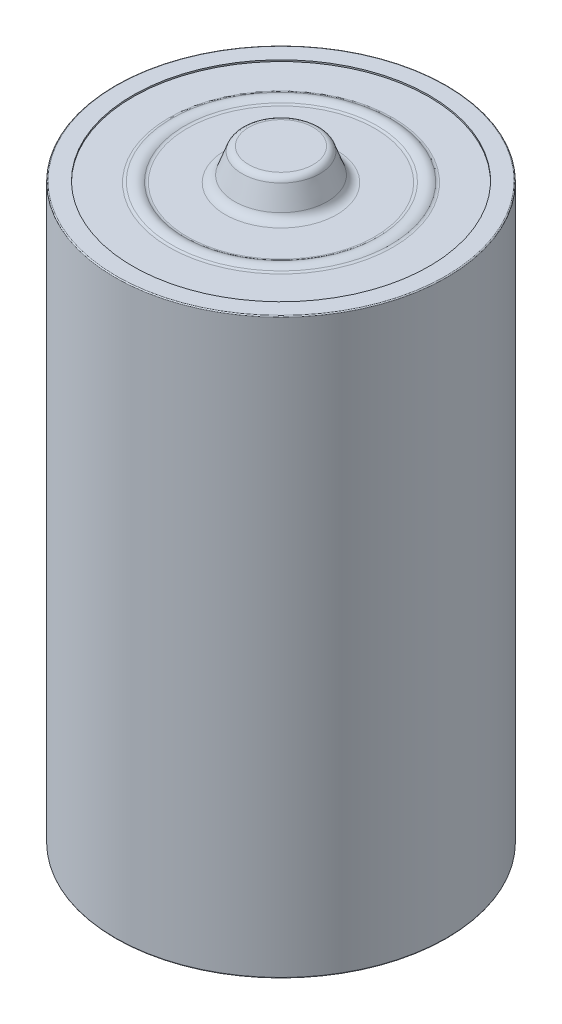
ISO-10303-21;
HEADER;
FILE_DESCRIPTION(('STEP AP214'),'2;1');
FILE_NAME('part.step','',(''),(''),'','','');
FILE_SCHEMA(('AUTOMOTIVE_DESIGN { 1 0 10303 214 1 1 1 1 }'));
ENDSEC;
DATA;
#1=APPLICATION_CONTEXT('core data for automotive mechanical design processes');
#2=APPLICATION_PROTOCOL_DEFINITION('international standard','automotive_design',2000,#1);
#3=PRODUCT_CONTEXT('',#1,'mechanical');
#4=PRODUCT('Part','Part','',(#3));
#5=PRODUCT_RELATED_PRODUCT_CATEGORY('part','',(#4));
#6=PRODUCT_DEFINITION_FORMATION('','',#4);
#7=PRODUCT_DEFINITION_CONTEXT('part definition',#1,'design');
#8=PRODUCT_DEFINITION('design','',#6,#7);
#9=PRODUCT_DEFINITION_SHAPE('','',#8);
#10=(LENGTH_UNIT() NAMED_UNIT(*) SI_UNIT(.MILLI.,.METRE.));
#11=(NAMED_UNIT(*) PLANE_ANGLE_UNIT() SI_UNIT($,.RADIAN.));
#12=(NAMED_UNIT(*) SI_UNIT($,.STERADIAN.) SOLID_ANGLE_UNIT());
#13=UNCERTAINTY_MEASURE_WITH_UNIT(LENGTH_MEASURE(1.E-05),#10,'distance_accuracy_value','');
#14=(GEOMETRIC_REPRESENTATION_CONTEXT(3) GLOBAL_UNCERTAINTY_ASSIGNED_CONTEXT((#13)) GLOBAL_UNIT_ASSIGNED_CONTEXT((#10,
#11,#12)) REPRESENTATION_CONTEXT('',''));
#15=CARTESIAN_POINT('',(0.,0.,0.));
#16=DIRECTION('',(0.,0.,1.));
#17=DIRECTION('',(1.,0.,0.));
#18=AXIS2_PLACEMENT_3D('',#15,#16,#17);
#19=CARTESIAN_POINT('',(0.,59.6,0.));
#20=DIRECTION('',(0.,-1.,0.));
#21=DIRECTION('',(0.,0.,-1.));
#22=AXIS2_PLACEMENT_3D('',#19,#20,#21);
#23=TOROIDAL_SURFACE('',#22,3.2098547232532,0.7);
#24=CARTESIAN_POINT('',(0.,59.839414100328,0.));
#25=DIRECTION('',(0.,-1.,0.));
#26=DIRECTION('',(0.,0.,-1.));
#27=AXIS2_PLACEMENT_3D('',#24,#25,#26);
#28=CIRCLE('',#27,3.86763955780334);
#29=CARTESIAN_POINT('',(0.,59.839414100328,-3.86763955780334));
#30=VERTEX_POINT('',#29);
#31=EDGE_CURVE('E122',#30,#30,#28,.T.);
#32=ORIENTED_EDGE('',*,*,#31,.F.);
#33=EDGE_LOOP('',(#32));
#34=FACE_BOUND('',#33,.T.);
#35=CARTESIAN_POINT('',(0.,60.3,0.));
#36=DIRECTION('',(0.,-1.,0.));
#37=DIRECTION('',(0.,0.,-1.));
#38=AXIS2_PLACEMENT_3D('',#35,#36,#37);
#39=CIRCLE('',#38,3.2098547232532);
#40=CARTESIAN_POINT('',(0.,60.3,-3.2098547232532));
#41=VERTEX_POINT('',#40);
#42=EDGE_CURVE('E10',#41,#41,#39,.T.);
#43=ORIENTED_EDGE('',*,*,#42,.T.);
#44=EDGE_LOOP('',(#43));
#45=FACE_BOUND('',#44,.T.);
#46=ADVANCED_FACE('F31',(#34,#45),#23,.T.);
#47=CARTESIAN_POINT('',(0.,60.3,3.2098547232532));
#48=DIRECTION('',(0.,-1.,0.));
#49=DIRECTION('',(0.,0.,-1.));
#50=AXIS2_PLACEMENT_3D('',#47,#48,#49);
#51=PLANE('',#50);
#52=ORIENTED_EDGE('',*,*,#42,.F.);
#53=EDGE_LOOP('',(#52));
#54=FACE_BOUND('',#53,.T.);
#55=ADVANCED_FACE('F129',(#54),#51,.F.);
#56=CARTESIAN_POINT('',(0.,1.,0.));
#57=DIRECTION('',(0.,1.,0.));
#58=DIRECTION('',(0.,0.,1.));
#59=AXIS2_PLACEMENT_3D('',#56,#57,#58);
#60=PLANE('',#59);
#61=CARTESIAN_POINT('',(0.,1.,0.));
#62=DIRECTION('',(0.,-1.,0.));
#63=DIRECTION('',(0.,0.,-1.));
#64=AXIS2_PLACEMENT_3D('',#61,#62,#63);
#65=CIRCLE('',#64,1.32679491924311);
#66=CARTESIAN_POINT('',(0.,1.,-1.32679491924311));
#67=VERTEX_POINT('',#66);
#68=EDGE_CURVE('E37',#67,#67,#65,.T.);
#69=ORIENTED_EDGE('',*,*,#68,.T.);
#70=EDGE_LOOP('',(#69));
#71=FACE_BOUND('',#70,.T.);
#72=ADVANCED_FACE('F133',(#71),#60,.F.);
#73=CARTESIAN_POINT('',(0.,0.7,0.));
#74=DIRECTION('',(0.,-1.,0.));
#75=DIRECTION('',(0.,0.,-1.));
#76=AXIS2_PLACEMENT_3D('',#73,#74,#75);
#77=TOROIDAL_SURFACE('',#76,1.32679491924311,0.3);
#78=ORIENTED_EDGE('',*,*,#68,.F.);
#79=EDGE_LOOP('',(#78));
#80=FACE_BOUND('',#79,.T.);
#81=CARTESIAN_POINT('',(0.,0.849999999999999,0.));
#82=DIRECTION('',(0.,-1.,0.));
#83=DIRECTION('',(0.,0.,-1.));
#84=AXIS2_PLACEMENT_3D('',#81,#82,#83);
#85=CIRCLE('',#84,1.58660254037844);
#86=CARTESIAN_POINT('',(0.,0.849999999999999,-1.58660254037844));
#87=VERTEX_POINT('',#86);
#88=EDGE_CURVE('E41',#87,#87,#85,.T.);
#89=ORIENTED_EDGE('',*,*,#88,.T.);
#90=EDGE_LOOP('',(#89));
#91=FACE_BOUND('',#90,.T.);
#92=ADVANCED_FACE('F138',(#80,#91),#77,.F.);
#93=CARTESIAN_POINT('',(0.,0.450000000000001,0.));
#94=DIRECTION('',(0.,-1.,0.));
#95=DIRECTION('',(0.,0.,-1.));
#96=AXIS2_PLACEMENT_3D('',#93,#94,#95);
#97=CONICAL_SURFACE('',#96,1.81754264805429,0.523598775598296);
#98=ORIENTED_EDGE('',*,*,#88,.F.);
#99=EDGE_LOOP('',(#98));
#100=FACE_BOUND('',#99,.T.);
#101=CARTESIAN_POINT('',(0.,0.450000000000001,0.));
#102=DIRECTION('',(0.,-1.,0.));
#103=DIRECTION('',(0.,0.,-1.));
#104=AXIS2_PLACEMENT_3D('',#101,#102,#103);
#105=CIRCLE('',#104,1.81754264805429);
#106=CARTESIAN_POINT('',(0.,0.450000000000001,-1.81754264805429));
#107=VERTEX_POINT('',#106);
#108=EDGE_CURVE('E45',#107,#107,#105,.T.);
#109=ORIENTED_EDGE('',*,*,#108,.T.);
#110=EDGE_LOOP('',(#109));
#111=FACE_BOUND('',#110,.T.);
#112=ADVANCED_FACE('F143',(#100,#111),#97,.F.);
#113=CARTESIAN_POINT('',(0.,0.7,0.));
#114=DIRECTION('',(0.,-1.,0.));
#115=DIRECTION('',(0.,0.,-1.));
#116=AXIS2_PLACEMENT_3D('',#113,#114,#115);
#117=TOROIDAL_SURFACE('',#116,2.25055534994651,0.5);
#118=ORIENTED_EDGE('',*,*,#108,.F.);
#119=EDGE_LOOP('',(#118));
#120=FACE_BOUND('',#119,.T.);
#121=CARTESIAN_POINT('',(0.,0.2,0.));
#122=DIRECTION('',(0.,-1.,0.));
#123=DIRECTION('',(0.,0.,-1.));
#124=AXIS2_PLACEMENT_3D('',#121,#122,#123);
#125=CIRCLE('',#124,2.25055534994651);
#126=CARTESIAN_POINT('',(0.,0.2,-2.25055534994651));
#127=VERTEX_POINT('',#126);
#128=EDGE_CURVE('E50',#127,#127,#125,.T.);
#129=ORIENTED_EDGE('',*,*,#128,.T.);
#130=EDGE_LOOP('',(#129));
#131=FACE_BOUND('',#130,.T.);
#132=ADVANCED_FACE('F147',(#120,#131),#117,.T.);
#133=CARTESIAN_POINT('',(0.,0.199999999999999,2.25055534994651));
#134=DIRECTION('',(0.,1.,0.));
#135=DIRECTION('',(0.,0.,1.));
#136=AXIS2_PLACEMENT_3D('',#133,#134,#135);
#137=PLANE('',#136);
#138=ORIENTED_EDGE('',*,*,#128,.F.);
#139=EDGE_LOOP('',(#138));
#140=FACE_BOUND('',#139,.T.);
#141=CARTESIAN_POINT('',(0.,0.199999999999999,0.));
#142=DIRECTION('',(0.,-1.,0.));
#143=DIRECTION('',(0.,0.,-1.));
#144=AXIS2_PLACEMENT_3D('',#141,#142,#143);
#145=CIRCLE('',#144,2.7618802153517);
#146=CARTESIAN_POINT('',(0.,0.199999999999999,-2.7618802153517));
#147=VERTEX_POINT('',#146);
#148=EDGE_CURVE('E53',#147,#147,#145,.T.);
#149=ORIENTED_EDGE('',*,*,#148,.T.);
#150=EDGE_LOOP('',(#149));
#151=FACE_BOUND('',#150,.T.);
#152=ADVANCED_FACE('F151',(#140,#151),#137,.F.);
#153=CARTESIAN_POINT('',(0.,16.9722672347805,0.));
#154=DIRECTION('',(0.,-1.,0.));
#155=DIRECTION('',(0.,0.,-1.));
#156=AXIS2_PLACEMENT_3D('',#153,#154,#155);
#157=DEGENERATE_TOROIDAL_SURFACE('',#156,2.7618802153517,16.7722672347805,.T.);
#158=ORIENTED_EDGE('',*,*,#148,.F.);
#159=EDGE_LOOP('',(#158));
#160=FACE_BOUND('',#159,.T.);
#161=CARTESIAN_POINT('',(0.,0.345657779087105,0.));
#162=DIRECTION('',(0.,-1.,0.));
#163=DIRECTION('',(0.,0.,-1.));
#164=AXIS2_PLACEMENT_3D('',#161,#162,#163);
#165=CIRCLE('',#164,4.96751078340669);
#166=CARTESIAN_POINT('',(0.,0.345657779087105,-4.96751078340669));
#167=VERTEX_POINT('',#166);
#168=EDGE_CURVE('E56',#167,#167,#165,.T.);
#169=ORIENTED_EDGE('',*,*,#168,.T.);
#170=EDGE_LOOP('',(#169));
#171=FACE_BOUND('',#170,.T.);
#172=ADVANCED_FACE('F155',(#160,#171),#157,.T.);
#173=CARTESIAN_POINT('',(0.,-0.15,0.));
#174=DIRECTION('',(0.,-1.,0.));
#175=DIRECTION('',(0.,0.,-1.));
#176=AXIS2_PLACEMENT_3D('',#173,#174,#175);
#177=TOROIDAL_SURFACE('',#176,5.03326309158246,0.500000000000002);
#178=ORIENTED_EDGE('',*,*,#168,.F.);
#179=EDGE_LOOP('',(#178));
#180=FACE_BOUND('',#179,.T.);
#181=CARTESIAN_POINT('',(0.,0.35,0.));
#182=DIRECTION('',(0.,-1.,0.));
#183=DIRECTION('',(0.,0.,-1.));
#184=AXIS2_PLACEMENT_3D('',#181,#182,#183);
#185=CIRCLE('',#184,5.03326309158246);
#186=CARTESIAN_POINT('',(0.,0.35,-5.03326309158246));
#187=VERTEX_POINT('',#186);
#188=EDGE_CURVE('E59',#187,#187,#185,.T.);
#189=ORIENTED_EDGE('',*,*,#188,.T.);
#190=EDGE_LOOP('',(#189));
#191=FACE_BOUND('',#190,.T.);
#192=ADVANCED_FACE('F159',(#180,#191),#177,.F.);
#193=CARTESIAN_POINT('',(0.,0.35,7.55522356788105));
#194=DIRECTION('',(0.,1.,0.));
#195=DIRECTION('',(0.,0.,1.));
#196=AXIS2_PLACEMENT_3D('',#193,#194,#195);
#197=PLANE('',#196);
#198=ORIENTED_EDGE('',*,*,#188,.F.);
#199=EDGE_LOOP('',(#198));
#200=FACE_BOUND('',#199,.T.);
#201=CARTESIAN_POINT('',(0.,0.35,0.));
#202=DIRECTION('',(0.,-1.,0.));
#203=DIRECTION('',(0.,0.,-1.));
#204=AXIS2_PLACEMENT_3D('',#201,#202,#203);
#205=CIRCLE('',#204,7.55522356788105);
#206=CARTESIAN_POINT('',(0.,0.35,-7.55522356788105));
#207=VERTEX_POINT('',#206);
#208=EDGE_CURVE('E62',#207,#207,#205,.T.);
#209=ORIENTED_EDGE('',*,*,#208,.T.);
#210=EDGE_LOOP('',(#209));
#211=FACE_BOUND('',#210,.T.);
#212=ADVANCED_FACE('F163',(#200,#211),#197,.F.);
#213=CARTESIAN_POINT('',(0.,-0.15,0.));
#214=DIRECTION('',(0.,-1.,0.));
#215=DIRECTION('',(0.,0.,-1.));
#216=AXIS2_PLACEMENT_3D('',#213,#214,#215);
#217=TOROIDAL_SURFACE('',#216,7.55522356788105,0.5);
#218=ORIENTED_EDGE('',*,*,#208,.F.);
#219=EDGE_LOOP('',(#218));
#220=FACE_BOUND('',#219,.T.);
#221=CARTESIAN_POINT('',(0.,0.238589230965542,0.));
#222=DIRECTION('',(0.,-1.,0.));
#223=DIRECTION('',(0.,0.,-1.));
#224=AXIS2_PLACEMENT_3D('',#221,#222,#223);
#225=CIRCLE('',#224,7.86986369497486);
#226=CARTESIAN_POINT('',(0.,0.238589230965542,-7.86986369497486));
#227=VERTEX_POINT('',#226);
#228=EDGE_CURVE('E65',#227,#227,#225,.T.);
#229=ORIENTED_EDGE('',*,*,#228,.T.);
#230=EDGE_LOOP('',(#229));
#231=FACE_BOUND('',#230,.T.);
#232=ADVANCED_FACE('F167',(#220,#231),#217,.F.);
#233=CARTESIAN_POINT('',(0.,1.17120338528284,0.));
#234=DIRECTION('',(0.,-1.,0.));
#235=DIRECTION('',(0.,0.,-1.));
#236=AXIS2_PLACEMENT_3D('',#233,#234,#235);
#237=TOROIDAL_SURFACE('',#236,8.625,1.2);
#238=ORIENTED_EDGE('',*,*,#228,.F.);
#239=EDGE_LOOP('',(#238));
#240=FACE_BOUND('',#239,.T.);
#241=CARTESIAN_POINT('',(0.,0.238589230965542,0.));
#242=DIRECTION('',(0.,-1.,0.));
#243=DIRECTION('',(0.,0.,-1.));
#244=AXIS2_PLACEMENT_3D('',#241,#242,#243);
#245=CIRCLE('',#244,9.38013630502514);
#246=CARTESIAN_POINT('',(0.,0.238589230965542,-9.38013630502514));
#247=VERTEX_POINT('',#246);
#248=EDGE_CURVE('E68',#247,#247,#245,.T.);
#249=ORIENTED_EDGE('',*,*,#248,.T.);
#250=EDGE_LOOP('',(#249));
#251=FACE_BOUND('',#250,.T.);
#252=ADVANCED_FACE('F171',(#240,#251),#237,.T.);
#253=CARTESIAN_POINT('',(0.,-0.15,0.));
#254=DIRECTION('',(0.,-1.,0.));
#255=DIRECTION('',(0.,0.,-1.));
#256=AXIS2_PLACEMENT_3D('',#253,#254,#255);
#257=TOROIDAL_SURFACE('',#256,9.69477643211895,0.5);
#258=ORIENTED_EDGE('',*,*,#248,.F.);
#259=EDGE_LOOP('',(#258));
#260=FACE_BOUND('',#259,.T.);
#261=CARTESIAN_POINT('',(0.,0.35,0.));
#262=DIRECTION('',(0.,-1.,0.));
#263=DIRECTION('',(0.,0.,-1.));
#264=AXIS2_PLACEMENT_3D('',#261,#262,#263);
#265=CIRCLE('',#264,9.69477643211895);
#266=CARTESIAN_POINT('',(0.,0.35,-9.69477643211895));
#267=VERTEX_POINT('',#266);
#268=EDGE_CURVE('E71',#267,#267,#265,.T.);
#269=ORIENTED_EDGE('',*,*,#268,.T.);
#270=EDGE_LOOP('',(#269));
#271=FACE_BOUND('',#270,.T.);
#272=ADVANCED_FACE('F175',(#260,#271),#257,.F.);
#273=CARTESIAN_POINT('',(0.,0.35,12.5));
#274=DIRECTION('',(0.,1.,0.));
#275=DIRECTION('',(0.,0.,1.));
#276=AXIS2_PLACEMENT_3D('',#273,#274,#275);
#277=PLANE('',#276);
#278=ORIENTED_EDGE('',*,*,#268,.F.);
#279=EDGE_LOOP('',(#278));
#280=FACE_BOUND('',#279,.T.);
#281=CARTESIAN_POINT('',(0.,0.35,0.));
#282=DIRECTION('',(0.,-1.,0.));
#283=DIRECTION('',(0.,0.,-1.));
#284=AXIS2_PLACEMENT_3D('',#281,#282,#283);
#285=CIRCLE('',#284,12.5);
#286=CARTESIAN_POINT('',(0.,0.35,-12.5));
#287=VERTEX_POINT('',#286);
#288=EDGE_CURVE('E74',#287,#287,#285,.T.);
#289=ORIENTED_EDGE('',*,*,#288,.T.);
#290=EDGE_LOOP('',(#289));
#291=FACE_BOUND('',#290,.T.);
#292=ADVANCED_FACE('F179',(#280,#291),#277,.F.);
#293=CARTESIAN_POINT('',(0.,0.,0.));
#294=DIRECTION('',(0.,-1.,0.));
#295=DIRECTION('',(0.,0.,-1.));
#296=AXIS2_PLACEMENT_3D('',#293,#294,#295);
#297=CYLINDRICAL_SURFACE('',#296,12.5);
#298=ORIENTED_EDGE('',*,*,#288,.F.);
#299=EDGE_LOOP('',(#298));
#300=FACE_BOUND('',#299,.T.);
#301=CARTESIAN_POINT('',(0.,0.25,0.));
#302=DIRECTION('',(0.,-1.,0.));
#303=DIRECTION('',(0.,0.,-1.));
#304=AXIS2_PLACEMENT_3D('',#301,#302,#303);
#305=CIRCLE('',#304,12.5);
#306=CARTESIAN_POINT('',(0.,0.25,-12.5));
#307=VERTEX_POINT('',#306);
#308=EDGE_CURVE('E77',#307,#307,#305,.T.);
#309=ORIENTED_EDGE('',*,*,#308,.T.);
#310=EDGE_LOOP('',(#309));
#311=FACE_BOUND('',#310,.T.);
#312=ADVANCED_FACE('F183',(#300,#311),#297,.F.);
#313=CARTESIAN_POINT('',(0.,0.25,13.5));
#314=DIRECTION('',(0.,1.,0.));
#315=DIRECTION('',(0.,0.,1.));
#316=AXIS2_PLACEMENT_3D('',#313,#314,#315);
#317=PLANE('',#316);
#318=ORIENTED_EDGE('',*,*,#308,.F.);
#319=EDGE_LOOP('',(#318));
#320=FACE_BOUND('',#319,.T.);
#321=CARTESIAN_POINT('',(0.,0.25,0.));
#322=DIRECTION('',(0.,-1.,0.));
#323=DIRECTION('',(0.,0.,-1.));
#324=AXIS2_PLACEMENT_3D('',#321,#322,#323);
#325=CIRCLE('',#324,13.5);
#326=CARTESIAN_POINT('',(0.,0.25,-13.5));
#327=VERTEX_POINT('',#326);
#328=EDGE_CURVE('E80',#327,#327,#325,.T.);
#329=ORIENTED_EDGE('',*,*,#328,.T.);
#330=EDGE_LOOP('',(#329));
#331=FACE_BOUND('',#330,.T.);
#332=ADVANCED_FACE('F187',(#320,#331),#317,.F.);
#333=CARTESIAN_POINT('',(0.,0.,0.));
#334=DIRECTION('',(0.,-1.,0.));
#335=DIRECTION('',(0.,0.,-1.));
#336=AXIS2_PLACEMENT_3D('',#333,#334,#335);
#337=CYLINDRICAL_SURFACE('',#336,13.5);
#338=ORIENTED_EDGE('',*,*,#328,.F.);
#339=EDGE_LOOP('',(#338));
#340=FACE_BOUND('',#339,.T.);
#341=CARTESIAN_POINT('',(0.,0.2,0.));
#342=DIRECTION('',(0.,-1.,0.));
#343=DIRECTION('',(0.,0.,-1.));
#344=AXIS2_PLACEMENT_3D('',#341,#342,#343);
#345=CIRCLE('',#344,13.5);
#346=CARTESIAN_POINT('',(0.,0.2,-13.5));
#347=VERTEX_POINT('',#346);
#348=EDGE_CURVE('E83',#347,#347,#345,.T.);
#349=ORIENTED_EDGE('',*,*,#348,.T.);
#350=EDGE_LOOP('',(#349));
#351=FACE_BOUND('',#350,.T.);
#352=ADVANCED_FACE('F191',(#340,#351),#337,.F.);
#353=CARTESIAN_POINT('',(0.,0.2,16.4));
#354=DIRECTION('',(0.,1.,0.));
#355=DIRECTION('',(0.,0.,1.));
#356=AXIS2_PLACEMENT_3D('',#353,#354,#355);
#357=PLANE('',#356);
#358=ORIENTED_EDGE('',*,*,#348,.F.);
#359=EDGE_LOOP('',(#358));
#360=FACE_BOUND('',#359,.T.);
#361=CARTESIAN_POINT('',(0.,0.2,0.));
#362=DIRECTION('',(0.,-1.,0.));
#363=DIRECTION('',(0.,0.,-1.));
#364=AXIS2_PLACEMENT_3D('',#361,#362,#363);
#365=CIRCLE('',#364,16.4);
#366=CARTESIAN_POINT('',(0.,0.2,-16.4));
#367=VERTEX_POINT('',#366);
#368=EDGE_CURVE('E86',#367,#367,#365,.T.);
#369=ORIENTED_EDGE('',*,*,#368,.T.);
#370=EDGE_LOOP('',(#369));
#371=FACE_BOUND('',#370,.T.);
#372=ADVANCED_FACE('F195',(#360,#371),#357,.F.);
#373=CARTESIAN_POINT('',(0.,0.3,0.));
#374=DIRECTION('',(0.,-1.,0.));
#375=DIRECTION('',(0.,0.,-1.));
#376=AXIS2_PLACEMENT_3D('',#373,#374,#375);
#377=TOROIDAL_SURFACE('',#376,16.4,0.0999999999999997);
#378=ORIENTED_EDGE('',*,*,#368,.F.);
#379=EDGE_LOOP('',(#378));
#380=FACE_BOUND('',#379,.T.);
#381=CARTESIAN_POINT('',(0.,0.300000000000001,0.));
#382=DIRECTION('',(0.,-1.,0.));
#383=DIRECTION('',(0.,0.,-1.));
#384=AXIS2_PLACEMENT_3D('',#381,#382,#383);
#385=CIRCLE('',#384,16.5);
#386=CARTESIAN_POINT('',(0.,0.300000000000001,-16.5));
#387=VERTEX_POINT('',#386);
#388=EDGE_CURVE('E89',#387,#387,#385,.T.);
#389=ORIENTED_EDGE('',*,*,#388,.T.);
#390=EDGE_LOOP('',(#389));
#391=FACE_BOUND('',#390,.T.);
#392=ADVANCED_FACE('F199',(#380,#391),#377,.T.);
#393=CARTESIAN_POINT('',(0.,0.,0.));
#394=DIRECTION('',(0.,-1.,0.));
#395=DIRECTION('',(0.,0.,-1.));
#396=AXIS2_PLACEMENT_3D('',#393,#394,#395);
#397=CYLINDRICAL_SURFACE('',#396,16.5);
#398=ORIENTED_EDGE('',*,*,#388,.F.);
#399=EDGE_LOOP('',(#398));
#400=FACE_BOUND('',#399,.T.);
#401=CARTESIAN_POINT('',(0.,57.2,0.));
#402=DIRECTION('',(0.,-1.,0.));
#403=DIRECTION('',(0.,0.,-1.));
#404=AXIS2_PLACEMENT_3D('',#401,#402,#403);
#405=CIRCLE('',#404,16.5);
#406=CARTESIAN_POINT('',(0.,57.2,-16.5));
#407=VERTEX_POINT('',#406);
#408=EDGE_CURVE('E92',#407,#407,#405,.T.);
#409=ORIENTED_EDGE('',*,*,#408,.T.);
#410=EDGE_LOOP('',(#409));
#411=FACE_BOUND('',#410,.T.);
#412=ADVANCED_FACE('F203',(#400,#411),#397,.T.);
#413=CARTESIAN_POINT('',(0.,57.2,0.));
#414=DIRECTION('',(0.,-1.,0.));
#415=DIRECTION('',(0.,0.,-1.));
#416=AXIS2_PLACEMENT_3D('',#413,#414,#415);
#417=TOROIDAL_SURFACE('',#416,16.4,0.100000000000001);
#418=ORIENTED_EDGE('',*,*,#408,.F.);
#419=EDGE_LOOP('',(#418));
#420=FACE_BOUND('',#419,.T.);
#421=CARTESIAN_POINT('',(0.,57.3,0.));
#422=DIRECTION('',(0.,-1.,0.));
#423=DIRECTION('',(0.,0.,-1.));
#424=AXIS2_PLACEMENT_3D('',#421,#422,#423);
#425=CIRCLE('',#424,16.4);
#426=CARTESIAN_POINT('',(0.,57.3,-16.4));
#427=VERTEX_POINT('',#426);
#428=EDGE_CURVE('E95',#427,#427,#425,.T.);
#429=ORIENTED_EDGE('',*,*,#428,.T.);
#430=EDGE_LOOP('',(#429));
#431=FACE_BOUND('',#430,.T.);
#432=ADVANCED_FACE('F207',(#420,#431),#417,.T.);
#433=CARTESIAN_POINT('',(0.,57.3,16.4));
#434=DIRECTION('',(0.,-1.,0.));
#435=DIRECTION('',(0.,0.,-1.));
#436=AXIS2_PLACEMENT_3D('',#433,#434,#435);
#437=PLANE('',#436);
#438=ORIENTED_EDGE('',*,*,#428,.F.);
#439=EDGE_LOOP('',(#438));
#440=FACE_BOUND('',#439,.T.);
#441=CARTESIAN_POINT('',(0.,57.3,0.));
#442=DIRECTION('',(0.,-1.,0.));
#443=DIRECTION('',(0.,0.,-1.));
#444=AXIS2_PLACEMENT_3D('',#441,#442,#443);
#445=CIRCLE('',#444,14.75);
#446=CARTESIAN_POINT('',(0.,57.3,-14.75));
#447=VERTEX_POINT('',#446);
#448=EDGE_CURVE('E98',#447,#447,#445,.T.);
#449=ORIENTED_EDGE('',*,*,#448,.T.);
#450=EDGE_LOOP('',(#449));
#451=FACE_BOUND('',#450,.T.);
#452=ADVANCED_FACE('F211',(#440,#451),#437,.F.);
#453=CARTESIAN_POINT('',(0.,0.,0.));
#454=DIRECTION('',(0.,-1.,0.));
#455=DIRECTION('',(0.,0.,-1.));
#456=AXIS2_PLACEMENT_3D('',#453,#454,#455);
#457=CYLINDRICAL_SURFACE('',#456,14.75);
#458=ORIENTED_EDGE('',*,*,#448,.F.);
#459=EDGE_LOOP('',(#458));
#460=FACE_BOUND('',#459,.T.);
#461=CARTESIAN_POINT('',(0.,57.15,0.));
#462=DIRECTION('',(0.,-1.,0.));
#463=DIRECTION('',(0.,0.,-1.));
#464=AXIS2_PLACEMENT_3D('',#461,#462,#463);
#465=CIRCLE('',#464,14.75);
#466=CARTESIAN_POINT('',(0.,57.15,-14.75));
#467=VERTEX_POINT('',#466);
#468=EDGE_CURVE('E101',#467,#467,#465,.T.);
#469=ORIENTED_EDGE('',*,*,#468,.T.);
#470=EDGE_LOOP('',(#469));
#471=FACE_BOUND('',#470,.T.);
#472=ADVANCED_FACE('F215',(#460,#471),#457,.F.);
#473=CARTESIAN_POINT('',(0.,57.15,14.75));
#474=DIRECTION('',(0.,-1.,0.));
#475=DIRECTION('',(0.,0.,-1.));
#476=AXIS2_PLACEMENT_3D('',#473,#474,#475);
#477=PLANE('',#476);
#478=ORIENTED_EDGE('',*,*,#468,.F.);
#479=EDGE_LOOP('',(#478));
#480=FACE_BOUND('',#479,.T.);
#481=CARTESIAN_POINT('',(0.,57.15,0.));
#482=DIRECTION('',(0.,-1.,0.));
#483=DIRECTION('',(0.,0.,-1.));
#484=AXIS2_PLACEMENT_3D('',#481,#482,#483);
#485=CIRCLE('',#484,11.1587080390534);
#486=CARTESIAN_POINT('',(0.,57.15,-11.1587080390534));
#487=VERTEX_POINT('',#486);
#488=EDGE_CURVE('E104',#487,#487,#485,.T.);
#489=ORIENTED_EDGE('',*,*,#488,.T.);
#490=EDGE_LOOP('',(#489));
#491=FACE_BOUND('',#490,.T.);
#492=ADVANCED_FACE('F219',(#480,#491),#477,.F.);
#493=CARTESIAN_POINT('',(0.,57.65,0.));
#494=DIRECTION('',(0.,-1.,0.));
#495=DIRECTION('',(0.,0.,-1.));
#496=AXIS2_PLACEMENT_3D('',#493,#494,#495);
#497=TOROIDAL_SURFACE('',#496,11.1587080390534,0.500000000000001);
#498=ORIENTED_EDGE('',*,*,#488,.F.);
#499=EDGE_LOOP('',(#498));
#500=FACE_BOUND('',#499,.T.);
#501=CARTESIAN_POINT('',(0.,57.2274265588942,0.));
#502=DIRECTION('',(0.,-1.,0.));
#503=DIRECTION('',(0.,0.,-1.));
#504=AXIS2_PLACEMENT_3D('',#501,#502,#503);
#505=CIRCLE('',#504,10.8914409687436);
#506=CARTESIAN_POINT('',(0.,57.2274265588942,-10.8914409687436));
#507=VERTEX_POINT('',#506);
#508=EDGE_CURVE('E107',#507,#507,#505,.T.);
#509=ORIENTED_EDGE('',*,*,#508,.T.);
#510=EDGE_LOOP('',(#509));
#511=FACE_BOUND('',#510,.T.);
#512=ADVANCED_FACE('F223',(#500,#511),#497,.F.);
#513=CARTESIAN_POINT('',(0.,56.2132503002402,0.));
#514=DIRECTION('',(0.,-1.,0.));
#515=DIRECTION('',(0.,0.,-1.));
#516=AXIS2_PLACEMENT_3D('',#513,#514,#515);
#517=TOROIDAL_SURFACE('',#516,10.25,1.2);
#518=ORIENTED_EDGE('',*,*,#508,.F.);
#519=EDGE_LOOP('',(#518));
#520=FACE_BOUND('',#519,.T.);
#521=CARTESIAN_POINT('',(0.,57.2274265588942,0.));
#522=DIRECTION('',(0.,-1.,0.));
#523=DIRECTION('',(0.,0.,-1.));
#524=AXIS2_PLACEMENT_3D('',#521,#522,#523);
#525=CIRCLE('',#524,9.60855903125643);
#526=CARTESIAN_POINT('',(0.,57.2274265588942,-9.60855903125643));
#527=VERTEX_POINT('',#526);
#528=EDGE_CURVE('E110',#527,#527,#525,.T.);
#529=ORIENTED_EDGE('',*,*,#528,.T.);
#530=EDGE_LOOP('',(#529));
#531=FACE_BOUND('',#530,.T.);
#532=ADVANCED_FACE('F227',(#520,#531),#517,.T.);
#533=CARTESIAN_POINT('',(0.,57.65,0.));
#534=DIRECTION('',(0.,-1.,0.));
#535=DIRECTION('',(0.,0.,-1.));
#536=AXIS2_PLACEMENT_3D('',#533,#534,#535);
#537=TOROIDAL_SURFACE('',#536,9.34129196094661,0.500000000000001);
#538=ORIENTED_EDGE('',*,*,#528,.F.);
#539=EDGE_LOOP('',(#538));
#540=FACE_BOUND('',#539,.T.);
#541=CARTESIAN_POINT('',(0.,57.15,0.));
#542=DIRECTION('',(0.,-1.,0.));
#543=DIRECTION('',(0.,0.,-1.));
#544=AXIS2_PLACEMENT_3D('',#541,#542,#543);
#545=CIRCLE('',#544,9.34129196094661);
#546=CARTESIAN_POINT('',(0.,57.15,-9.34129196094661));
#547=VERTEX_POINT('',#546);
#548=EDGE_CURVE('E113',#547,#547,#545,.T.);
#549=ORIENTED_EDGE('',*,*,#548,.T.);
#550=EDGE_LOOP('',(#549));
#551=FACE_BOUND('',#550,.T.);
#552=ADVANCED_FACE('F231',(#540,#551),#537,.F.);
#553=CARTESIAN_POINT('',(0.,57.15,9.34129196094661));
#554=DIRECTION('',(0.,-1.,0.));
#555=DIRECTION('',(0.,0.,-1.));
#556=AXIS2_PLACEMENT_3D('',#553,#554,#555);
#557=PLANE('',#556);
#558=ORIENTED_EDGE('',*,*,#548,.F.);
#559=EDGE_LOOP('',(#558));
#560=FACE_BOUND('',#559,.T.);
#561=CARTESIAN_POINT('',(0.,57.15,0.));
#562=DIRECTION('',(0.,-1.,0.));
#563=DIRECTION('',(0.,0.,-1.));
#564=AXIS2_PLACEMENT_3D('',#561,#562,#563);
#565=CIRCLE('',#564,5.54671377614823);
#566=CARTESIAN_POINT('',(0.,57.15,-5.54671377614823));
#567=VERTEX_POINT('',#566);
#568=EDGE_CURVE('E116',#567,#567,#565,.T.);
#569=ORIENTED_EDGE('',*,*,#568,.T.);
#570=EDGE_LOOP('',(#569));
#571=FACE_BOUND('',#570,.T.);
#572=ADVANCED_FACE('F235',(#560,#571),#557,.F.);
#573=CARTESIAN_POINT('',(0.,58.15,0.));
#574=DIRECTION('',(0.,-1.,0.));
#575=DIRECTION('',(0.,0.,-1.));
#576=AXIS2_PLACEMENT_3D('',#573,#574,#575);
#577=TOROIDAL_SURFACE('',#576,5.54671377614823,1.);
#578=ORIENTED_EDGE('',*,*,#568,.F.);
#579=EDGE_LOOP('',(#578));
#580=FACE_BOUND('',#579,.T.);
#581=CARTESIAN_POINT('',(0.,57.8079798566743,0.));
#582=DIRECTION('',(0.,-1.,0.));
#583=DIRECTION('',(0.,0.,-1.));
#584=AXIS2_PLACEMENT_3D('',#581,#582,#583);
#585=CIRCLE('',#584,4.60702115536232);
#586=CARTESIAN_POINT('',(0.,57.8079798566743,-4.60702115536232));
#587=VERTEX_POINT('',#586);
#588=EDGE_CURVE('E119',#587,#587,#585,.T.);
#589=ORIENTED_EDGE('',*,*,#588,.T.);
#590=EDGE_LOOP('',(#589));
#591=FACE_BOUND('',#590,.T.);
#592=ADVANCED_FACE('F239',(#580,#591),#577,.F.);
#593=CARTESIAN_POINT('',(0.,59.839414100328,0.));
#594=DIRECTION('',(0.,-1.,0.));
#595=DIRECTION('',(0.,0.,-1.));
#596=AXIS2_PLACEMENT_3D('',#593,#594,#595);
#597=CONICAL_SURFACE('',#596,3.86763955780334,0.349065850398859);
#598=ORIENTED_EDGE('',*,*,#588,.F.);
#599=EDGE_LOOP('',(#598));
#600=FACE_BOUND('',#599,.T.);
#601=ORIENTED_EDGE('',*,*,#31,.T.);
#602=EDGE_LOOP('',(#601));
#603=FACE_BOUND('',#602,.T.);
#604=ADVANCED_FACE('F126',(#600,#603),#597,.T.);
#605=CLOSED_SHELL('',(#46,#55,#72,#92,#112,#132,#152,#172,#192,#212,#232,#252,#272,#292,#312,
#332,#352,#372,#392,#412,#432,#452,#472,#492,#512,#532,#552,#572,#592,#604));
#606=MANIFOLD_SOLID_BREP('B2',#605);
#607=ADVANCED_BREP_SHAPE_REPRESENTATION('',(#18,#606),#14);
#608=SHAPE_DEFINITION_REPRESENTATION(#9,#607);
ENDSEC;
END-ISO-10303-21;
